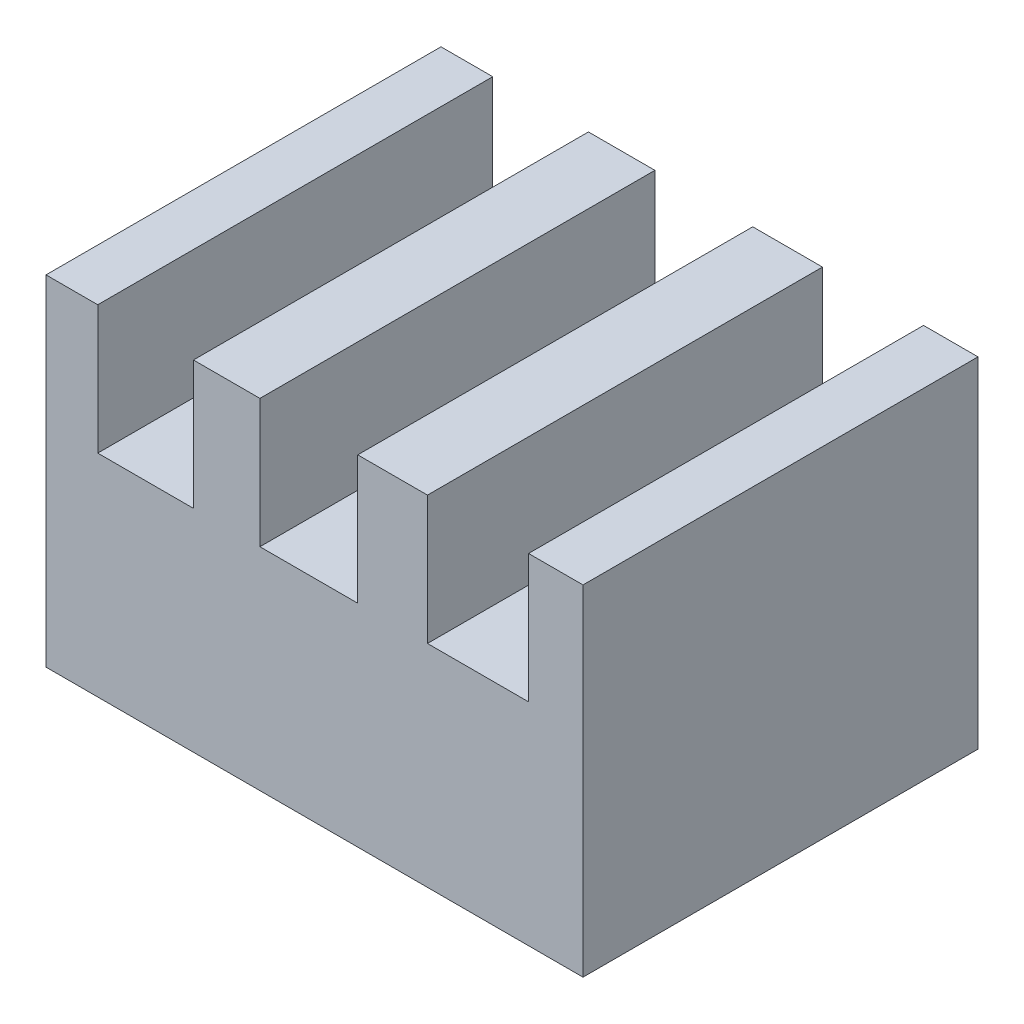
from build123d import *

# Parameters (mm, degrees)
SKETCH_1_W          = 52.162890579
SKETCH_1_H          = 38.368703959
EXTRUDE_1_DEPTH     = 33
SKETCH_2_W          = 9.293281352
SKETCH_2_H          = 12.481057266
SKETCH_2_W_2        = 9.503299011
SKETCH_2_W_3        = 9.818325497
CUT_EXTRUDE_1_DEPTH = 43


with BuildPart() as part:
    # Sketch 1 → Extrude 1 (new body)
    with BuildSketch(Plane(origin=(0, 0, 0), x_dir=(1, 0, 0), z_dir=(0, 1, 0))):
        with Locations((27.472455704, 19.18435198)):
            Rectangle(SKETCH_1_W, SKETCH_1_H)
    extrude(amount=EXTRUDE_1_DEPTH)

    # Sketch 2 → Cut-Extrude 1 (cut)
    with BuildSketch(Plane.XY):
        with Locations((11.064826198, 26.759471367)):
            Rectangle(SKETCH_2_W, SKETCH_2_H)
        with Locations((26.921159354, 26.759471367)):
            Rectangle(SKETCH_2_W_2, SKETCH_2_H)
        with Locations((43.355041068, 26.759471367)):
            Rectangle(SKETCH_2_W_3, SKETCH_2_H)
    extrude(amount=-CUT_EXTRUDE_1_DEPTH, mode=Mode.SUBTRACT)


solid = part.part
